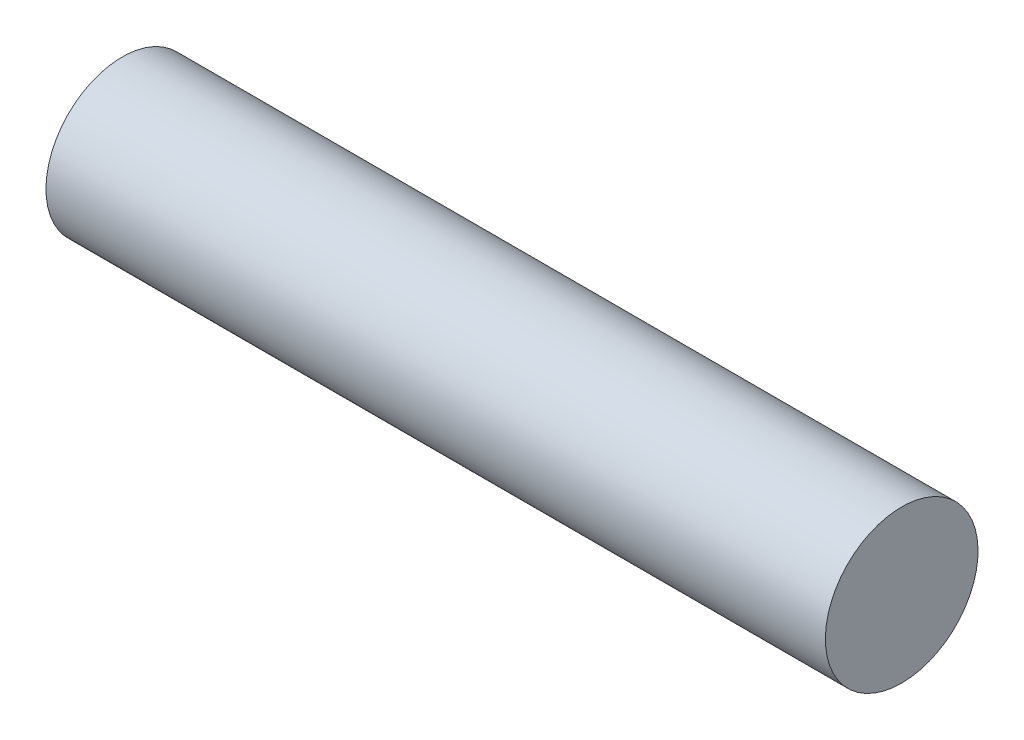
from build123d import *

# Parameters (mm, degrees)
SKETCH1_W = 30.48
SKETCH1_H = 2.9845


with BuildPart() as part:
    # Sketch1 → Revolve1 (revolve)
    with BuildSketch(Plane.XY, mode=Mode.PRIVATE) as revolve1_sk:
        with Locations((15.24, 1.49225)):
            Rectangle(SKETCH1_W, SKETCH1_H)
    revolve(revolve1_sk.sketch.rotate(Axis((30.48, 0, 0), (-1, 0, 0)), 180), axis=Axis((30.48, 0, 0), (-1, 0, 0)))


solid = part.part
